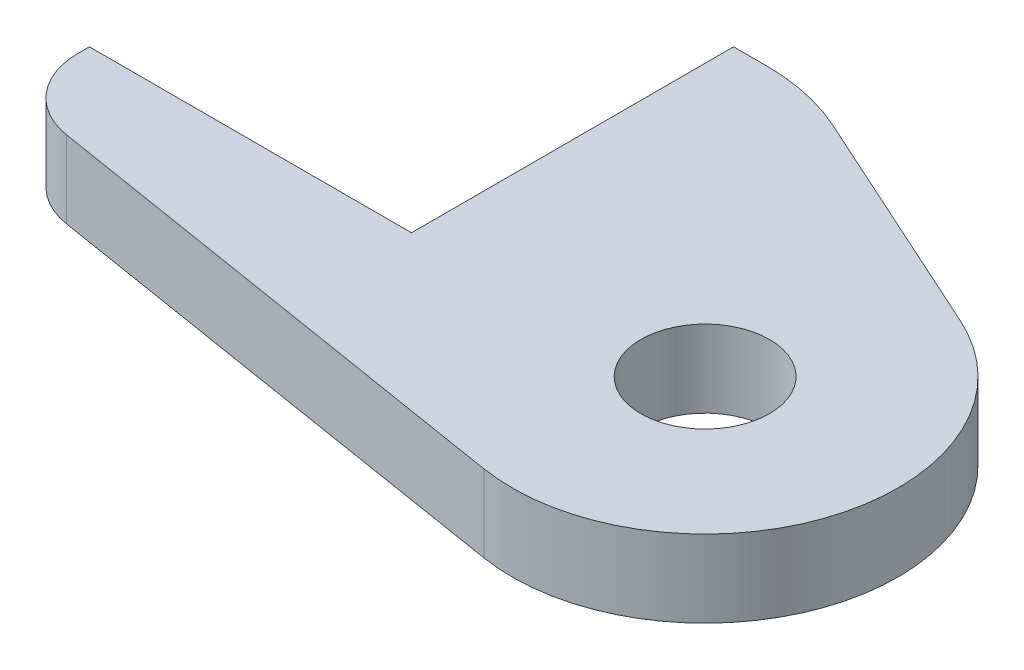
ISO-10303-21;
HEADER;
FILE_DESCRIPTION(('STEP AP214'),'2;1');
FILE_NAME('part.step','',(''),(''),'','','');
FILE_SCHEMA(('AUTOMOTIVE_DESIGN { 1 0 10303 214 1 1 1 1 }'));
ENDSEC;
DATA;
#1=APPLICATION_CONTEXT('core data for automotive mechanical design processes');
#2=APPLICATION_PROTOCOL_DEFINITION('international standard','automotive_design',2000,#1);
#3=PRODUCT_CONTEXT('',#1,'mechanical');
#4=PRODUCT('Part','Part','',(#3));
#5=PRODUCT_RELATED_PRODUCT_CATEGORY('part','',(#4));
#6=PRODUCT_DEFINITION_FORMATION('','',#4);
#7=PRODUCT_DEFINITION_CONTEXT('part definition',#1,'design');
#8=PRODUCT_DEFINITION('design','',#6,#7);
#9=PRODUCT_DEFINITION_SHAPE('','',#8);
#10=(LENGTH_UNIT() NAMED_UNIT(*) SI_UNIT(.MILLI.,.METRE.));
#11=(NAMED_UNIT(*) PLANE_ANGLE_UNIT() SI_UNIT($,.RADIAN.));
#12=(NAMED_UNIT(*) SI_UNIT($,.STERADIAN.) SOLID_ANGLE_UNIT());
#13=UNCERTAINTY_MEASURE_WITH_UNIT(LENGTH_MEASURE(1.E-05),#10,'distance_accuracy_value','');
#14=(GEOMETRIC_REPRESENTATION_CONTEXT(3) GLOBAL_UNCERTAINTY_ASSIGNED_CONTEXT((#13)) GLOBAL_UNIT_ASSIGNED_CONTEXT((#10,
#11,#12)) REPRESENTATION_CONTEXT('',''));
#15=CARTESIAN_POINT('',(0.,0.,0.));
#16=DIRECTION('',(0.,0.,1.));
#17=DIRECTION('',(1.,0.,0.));
#18=AXIS2_PLACEMENT_3D('',#15,#16,#17);
#19=CARTESIAN_POINT('',(197.104,4.7625,-155.428217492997));
#20=DIRECTION('',(0.,1.,0.));
#21=DIRECTION('',(0.,0.,1.));
#22=AXIS2_PLACEMENT_3D('',#19,#20,#21);
#23=PLANE('',#22);
#24=DIRECTION('',(0.,0.,1.));
#25=VECTOR('',#24,1.);
#26=CARTESIAN_POINT('',(227.33,4.7625,-160.02));
#27=LINE('',#26,#25);
#28=CARTESIAN_POINT('',(227.33,4.7625,-196.596));
#29=VERTEX_POINT('',#28);
#30=CARTESIAN_POINT('',(227.33,4.7625,-156.845));
#31=VERTEX_POINT('',#30);
#32=EDGE_CURVE('E194',#29,#31,#27,.T.);
#33=ORIENTED_EDGE('',*,*,#32,.T.);
#34=DIRECTION('',(-1.,0.,0.));
#35=VECTOR('',#34,1.);
#36=CARTESIAN_POINT('',(187.579,4.7625,-156.845));
#37=LINE('',#36,#35);
#38=CARTESIAN_POINT('',(187.579,4.7625,-156.845));
#39=VERTEX_POINT('',#38);
#40=EDGE_CURVE('E130',#31,#39,#37,.T.);
#41=ORIENTED_EDGE('',*,*,#40,.T.);
#42=DIRECTION('',(0.,0.,1.));
#43=VECTOR('',#42,1.);
#44=CARTESIAN_POINT('',(187.579,4.7625,-160.02));
#45=LINE('',#44,#43);
#46=CARTESIAN_POINT('',(187.579,4.7625,-155.428217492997));
#47=VERTEX_POINT('',#46);
#48=EDGE_CURVE('E123',#39,#47,#45,.T.);
#49=ORIENTED_EDGE('',*,*,#48,.T.);
#50=CARTESIAN_POINT('',(197.104,4.7625,-155.428217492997));
#51=DIRECTION('',(0.,1.,0.));
#52=DIRECTION('',(0.,0.,1.));
#53=AXIS2_PLACEMENT_3D('',#50,#51,#52);
#54=CIRCLE('',#53,9.52499999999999);
#55=CARTESIAN_POINT('',(195.583200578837,4.7625,-146.025409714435));
#56=VERTEX_POINT('',#55);
#57=EDGE_CURVE('E127',#47,#56,#54,.T.);
#58=ORIENTED_EDGE('',*,*,#57,.T.);
#59=DIRECTION('',(0.987171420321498,0.,0.159663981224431));
#60=VECTOR('',#59,1.);
#61=CARTESIAN_POINT('',(195.583200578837,4.7625,-146.025409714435));
#62=LINE('',#61,#60);
#63=CARTESIAN_POINT('',(257.014091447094,4.7625,-136.089647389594));
#64=VERTEX_POINT('',#63);
#65=EDGE_CURVE('E146',#56,#64,#62,.T.);
#66=ORIENTED_EDGE('',*,*,#65,.T.);
#67=CARTESIAN_POINT('',(260.81609,4.7625,-159.596666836));
#68=DIRECTION('',(0.,1.,0.));
#69=DIRECTION('',(0.,0.,1.));
#70=AXIS2_PLACEMENT_3D('',#67,#68,#69);
#71=CIRCLE('',#70,23.8125);
#72=CARTESIAN_POINT('',(270.643643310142,4.7625,-181.286626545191));
#73=VERTEX_POINT('',#72);
#74=EDGE_CURVE('E148',#64,#73,#71,.T.);
#75=ORIENTED_EDGE('',*,*,#74,.T.);
#76=DIRECTION('',(-0.910864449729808,0.,-0.412705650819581));
#77=VECTOR('',#76,1.);
#78=CARTESIAN_POINT('',(241.851869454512,4.7625,-194.331957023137));
#79=LINE('',#78,#77);
#80=CARTESIAN_POINT('',(241.851869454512,4.7625,-194.331957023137));
#81=VERTEX_POINT('',#80);
#82=EDGE_CURVE('E153',#73,#81,#79,.T.);
#83=ORIENTED_EDGE('',*,*,#82,.T.);
#84=CARTESIAN_POINT('',(231.369145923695,4.7625,-171.196));
#85=DIRECTION('',(0.,1.,0.));
#86=DIRECTION('',(0.,0.,-1.));
#87=AXIS2_PLACEMENT_3D('',#84,#85,#86);
#88=CIRCLE('',#87,25.4);
#89=CARTESIAN_POINT('',(231.369145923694,4.7625,-196.596));
#90=VERTEX_POINT('',#89);
#91=EDGE_CURVE('E155',#81,#90,#88,.T.);
#92=ORIENTED_EDGE('',*,*,#91,.T.);
#93=DIRECTION('',(-1.,0.,0.));
#94=VECTOR('',#93,1.);
#95=CARTESIAN_POINT('',(224.155,4.7625,-196.596));
#96=LINE('',#95,#94);
#97=EDGE_CURVE('E157',#90,#29,#96,.T.);
#98=ORIENTED_EDGE('',*,*,#97,.T.);
#99=EDGE_LOOP('',(#33,#41,#49,#58,#66,#75,#83,#92,#98));
#100=FACE_BOUND('',#99,.T.);
#101=CARTESIAN_POINT('',(260.81609,4.7625,-159.596666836));
#102=DIRECTION('',(0.,1.,0.));
#103=DIRECTION('',(0.,0.,1.));
#104=AXIS2_PLACEMENT_3D('',#101,#102,#103);
#105=CIRCLE('',#104,7.93749999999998);
#106=CARTESIAN_POINT('',(260.81609,4.7625,-167.534166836));
#107=VERTEX_POINT('',#106);
#108=EDGE_CURVE('E163',#107,#107,#105,.T.);
#109=ORIENTED_EDGE('',*,*,#108,.F.);
#110=EDGE_LOOP('',(#109));
#111=FACE_BOUND('',#110,.T.);
#112=ADVANCED_FACE('F34',(#100,#111),#23,.T.);
#113=CARTESIAN_POINT('',(197.104,-4.7625,-155.428217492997));
#114=DIRECTION('',(0.,1.,0.));
#115=DIRECTION('',(0.,0.,1.));
#116=AXIS2_PLACEMENT_3D('',#113,#114,#115);
#117=PLANE('',#116);
#118=DIRECTION('',(0.,0.,1.));
#119=VECTOR('',#118,1.);
#120=CARTESIAN_POINT('',(187.579,-4.7625,-160.02));
#121=LINE('',#120,#119);
#122=CARTESIAN_POINT('',(187.579,-4.7625,-156.845));
#123=VERTEX_POINT('',#122);
#124=CARTESIAN_POINT('',(187.579,-4.7625,-155.428217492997));
#125=VERTEX_POINT('',#124);
#126=EDGE_CURVE('E137',#123,#125,#121,.T.);
#127=ORIENTED_EDGE('',*,*,#126,.F.);
#128=DIRECTION('',(1.,0.,0.));
#129=VECTOR('',#128,1.);
#130=CARTESIAN_POINT('',(197.104,-4.7625,-156.845));
#131=LINE('',#130,#129);
#132=CARTESIAN_POINT('',(227.33,-4.7625,-156.845));
#133=VERTEX_POINT('',#132);
#134=EDGE_CURVE('E11',#123,#133,#131,.T.);
#135=ORIENTED_EDGE('',*,*,#134,.T.);
#136=DIRECTION('',(0.,0.,-1.));
#137=VECTOR('',#136,1.);
#138=CARTESIAN_POINT('',(227.33,-4.7625,-155.428217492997));
#139=LINE('',#138,#137);
#140=CARTESIAN_POINT('',(227.33,-4.7625,-196.596));
#141=VERTEX_POINT('',#140);
#142=EDGE_CURVE('E44',#133,#141,#139,.T.);
#143=ORIENTED_EDGE('',*,*,#142,.T.);
#144=DIRECTION('',(-1.,0.,0.));
#145=VECTOR('',#144,1.);
#146=CARTESIAN_POINT('',(224.155,-4.7625,-196.596));
#147=LINE('',#146,#145);
#148=CARTESIAN_POINT('',(231.369145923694,-4.7625,-196.596));
#149=VERTEX_POINT('',#148);
#150=EDGE_CURVE('E132',#149,#141,#147,.T.);
#151=ORIENTED_EDGE('',*,*,#150,.F.);
#152=CARTESIAN_POINT('',(231.369145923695,-4.7625,-171.196));
#153=DIRECTION('',(0.,1.,0.));
#154=DIRECTION('',(0.,0.,-1.));
#155=AXIS2_PLACEMENT_3D('',#152,#153,#154);
#156=CIRCLE('',#155,25.4);
#157=CARTESIAN_POINT('',(241.851869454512,-4.7625,-194.331957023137));
#158=VERTEX_POINT('',#157);
#159=EDGE_CURVE('E171',#158,#149,#156,.T.);
#160=ORIENTED_EDGE('',*,*,#159,.F.);
#161=DIRECTION('',(-0.910864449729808,0.,-0.412705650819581));
#162=VECTOR('',#161,1.);
#163=CARTESIAN_POINT('',(241.851869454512,-4.7625,-194.331957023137));
#164=LINE('',#163,#162);
#165=CARTESIAN_POINT('',(270.643643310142,-4.7625,-181.286626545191));
#166=VERTEX_POINT('',#165);
#167=EDGE_CURVE('E169',#166,#158,#164,.T.);
#168=ORIENTED_EDGE('',*,*,#167,.F.);
#169=CARTESIAN_POINT('',(260.81609,-4.7625,-159.596666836));
#170=DIRECTION('',(0.,1.,0.));
#171=DIRECTION('',(0.,0.,1.));
#172=AXIS2_PLACEMENT_3D('',#169,#170,#171);
#173=CIRCLE('',#172,23.8125);
#174=CARTESIAN_POINT('',(257.014091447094,-4.7625,-136.089647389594));
#175=VERTEX_POINT('',#174);
#176=EDGE_CURVE('E167',#175,#166,#173,.T.);
#177=ORIENTED_EDGE('',*,*,#176,.F.);
#178=DIRECTION('',(0.987171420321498,0.,0.159663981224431));
#179=VECTOR('',#178,1.);
#180=CARTESIAN_POINT('',(195.583200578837,-4.7625,-146.025409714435));
#181=LINE('',#180,#179);
#182=CARTESIAN_POINT('',(195.583200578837,-4.7625,-146.025409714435));
#183=VERTEX_POINT('',#182);
#184=EDGE_CURVE('E165',#183,#175,#181,.T.);
#185=ORIENTED_EDGE('',*,*,#184,.F.);
#186=CARTESIAN_POINT('',(197.104,-4.7625,-155.428217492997));
#187=DIRECTION('',(0.,1.,0.));
#188=DIRECTION('',(0.,0.,1.));
#189=AXIS2_PLACEMENT_3D('',#186,#187,#188);
#190=CIRCLE('',#189,9.52499999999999);
#191=EDGE_CURVE('E162',#125,#183,#190,.T.);
#192=ORIENTED_EDGE('',*,*,#191,.F.);
#193=EDGE_LOOP('',(#127,#135,#143,#151,#160,#168,#177,#185,#192));
#194=FACE_BOUND('',#193,.T.);
#195=CARTESIAN_POINT('',(260.81609,-4.7625,-159.596666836));
#196=DIRECTION('',(0.,1.,0.));
#197=DIRECTION('',(0.,0.,1.));
#198=AXIS2_PLACEMENT_3D('',#195,#196,#197);
#199=CIRCLE('',#198,7.93749999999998);
#200=CARTESIAN_POINT('',(260.81609,-4.7625,-167.534166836));
#201=VERTEX_POINT('',#200);
#202=EDGE_CURVE('E216',#201,#201,#199,.T.);
#203=ORIENTED_EDGE('',*,*,#202,.T.);
#204=EDGE_LOOP('',(#203));
#205=FACE_BOUND('',#204,.T.);
#206=ADVANCED_FACE('F248',(#194,#205),#117,.F.);
#207=CARTESIAN_POINT('',(224.155,4.7625,-160.02));
#208=DIRECTION('',(0.,0.,1.));
#209=DIRECTION('',(1.,0.,0.));
#210=AXIS2_PLACEMENT_3D('',#207,#208,#209);
#211=PLANE('',#210);
#212=DIRECTION('',(0.,-1.,0.));
#213=VECTOR('',#212,1.);
#214=CARTESIAN_POINT('',(187.579,4.7625,-160.02));
#215=LINE('',#214,#213);
#216=CARTESIAN_POINT('',(187.579,1.5875,-160.02));
#217=VERTEX_POINT('',#216);
#218=CARTESIAN_POINT('',(187.579,-1.5875,-160.02));
#219=VERTEX_POINT('',#218);
#220=EDGE_CURVE('E140',#217,#219,#215,.T.);
#221=ORIENTED_EDGE('',*,*,#220,.F.);
#222=DIRECTION('',(1.,0.,0.));
#223=VECTOR('',#222,1.);
#224=CARTESIAN_POINT('',(224.155,1.5875,-160.02));
#225=LINE('',#224,#223);
#226=CARTESIAN_POINT('',(224.155,1.5875,-160.02));
#227=VERTEX_POINT('',#226);
#228=EDGE_CURVE('E204',#217,#227,#225,.T.);
#229=ORIENTED_EDGE('',*,*,#228,.T.);
#230=DIRECTION('',(0.,-1.,0.));
#231=VECTOR('',#230,1.);
#232=CARTESIAN_POINT('',(224.155,4.7625,-160.02));
#233=LINE('',#232,#231);
#234=CARTESIAN_POINT('',(224.155,-1.5875,-160.02));
#235=VERTEX_POINT('',#234);
#236=EDGE_CURVE('E160',#227,#235,#233,.T.);
#237=ORIENTED_EDGE('',*,*,#236,.T.);
#238=DIRECTION('',(-1.,0.,0.));
#239=VECTOR('',#238,1.);
#240=CARTESIAN_POINT('',(224.155,-1.5875,-160.02));
#241=LINE('',#240,#239);
#242=EDGE_CURVE('E201',#235,#219,#241,.T.);
#243=ORIENTED_EDGE('',*,*,#242,.T.);
#244=EDGE_LOOP('',(#221,#229,#237,#243));
#245=FACE_BOUND('',#244,.T.);
#246=ADVANCED_FACE('F275',(#245),#211,.F.);
#247=CARTESIAN_POINT('',(187.579,4.7625,-160.02));
#248=DIRECTION('',(1.,0.,0.));
#249=DIRECTION('',(0.,0.,-1.));
#250=AXIS2_PLACEMENT_3D('',#247,#248,#249);
#251=PLANE('',#250);
#252=ORIENTED_EDGE('',*,*,#48,.F.);
#253=DIRECTION('',(0.,-0.707106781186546,-0.707106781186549));
#254=VECTOR('',#253,1.);
#255=CARTESIAN_POINT('',(187.579,4.7625,-156.845));
#256=LINE('',#255,#254);
#257=EDGE_CURVE('E199',#39,#217,#256,.T.);
#258=ORIENTED_EDGE('',*,*,#257,.T.);
#259=ORIENTED_EDGE('',*,*,#220,.T.);
#260=DIRECTION('',(0.,0.707106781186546,-0.707106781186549));
#261=VECTOR('',#260,1.);
#262=CARTESIAN_POINT('',(187.579,-1.5875,-160.02));
#263=LINE('',#262,#261);
#264=EDGE_CURVE('E197',#219,#123,#263,.F.);
#265=ORIENTED_EDGE('',*,*,#264,.T.);
#266=ORIENTED_EDGE('',*,*,#126,.T.);
#267=DIRECTION('',(0.,-1.,0.));
#268=VECTOR('',#267,1.);
#269=CARTESIAN_POINT('',(187.579,4.7625,-155.428217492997));
#270=LINE('',#269,#268);
#271=EDGE_CURVE('E135',#47,#125,#270,.T.);
#272=ORIENTED_EDGE('',*,*,#271,.F.);
#273=EDGE_LOOP('',(#252,#258,#259,#265,#266,#272));
#274=FACE_BOUND('',#273,.T.);
#275=ADVANCED_FACE('F136',(#274),#251,.F.);
#276=CARTESIAN_POINT('',(197.104,4.7625,-155.428217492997));
#277=DIRECTION('',(0.,-1.,0.));
#278=DIRECTION('',(0.,0.,-1.));
#279=AXIS2_PLACEMENT_3D('',#276,#277,#278);
#280=CYLINDRICAL_SURFACE('',#279,9.52499999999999);
#281=ORIENTED_EDGE('',*,*,#191,.T.);
#282=DIRECTION('',(0.,-1.,0.));
#283=VECTOR('',#282,1.);
#284=CARTESIAN_POINT('',(195.583200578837,4.7625,-146.025409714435));
#285=LINE('',#284,#283);
#286=EDGE_CURVE('E141',#56,#183,#285,.T.);
#287=ORIENTED_EDGE('',*,*,#286,.F.);
#288=ORIENTED_EDGE('',*,*,#57,.F.);
#289=ORIENTED_EDGE('',*,*,#271,.T.);
#290=EDGE_LOOP('',(#281,#287,#288,#289));
#291=FACE_BOUND('',#290,.T.);
#292=ADVANCED_FACE('F143',(#291),#280,.T.);
#293=CARTESIAN_POINT('',(195.583200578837,4.7625,-146.025409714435));
#294=DIRECTION('',(0.159663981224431,0.,-0.987171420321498));
#295=DIRECTION('',(-0.987171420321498,0.,-0.159663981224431));
#296=AXIS2_PLACEMENT_3D('',#293,#294,#295);
#297=PLANE('',#296);
#298=ORIENTED_EDGE('',*,*,#184,.T.);
#299=DIRECTION('',(0.,-1.,0.));
#300=VECTOR('',#299,1.);
#301=CARTESIAN_POINT('',(257.014091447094,4.7625,-136.089647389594));
#302=LINE('',#301,#300);
#303=EDGE_CURVE('E188',#64,#175,#302,.T.);
#304=ORIENTED_EDGE('',*,*,#303,.F.);
#305=ORIENTED_EDGE('',*,*,#65,.F.);
#306=ORIENTED_EDGE('',*,*,#286,.T.);
#307=EDGE_LOOP('',(#298,#304,#305,#306));
#308=FACE_BOUND('',#307,.T.);
#309=ADVANCED_FACE('F261',(#308),#297,.F.);
#310=CARTESIAN_POINT('',(260.81609,4.7625,-159.596666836));
#311=DIRECTION('',(0.,-1.,0.));
#312=DIRECTION('',(0.,0.,-1.));
#313=AXIS2_PLACEMENT_3D('',#310,#311,#312);
#314=CYLINDRICAL_SURFACE('',#313,23.8125);
#315=ORIENTED_EDGE('',*,*,#176,.T.);
#316=DIRECTION('',(0.,-1.,0.));
#317=VECTOR('',#316,1.);
#318=CARTESIAN_POINT('',(270.643643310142,4.7625,-181.286626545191));
#319=LINE('',#318,#317);
#320=EDGE_CURVE('E185',#73,#166,#319,.T.);
#321=ORIENTED_EDGE('',*,*,#320,.F.);
#322=ORIENTED_EDGE('',*,*,#74,.F.);
#323=ORIENTED_EDGE('',*,*,#303,.T.);
#324=EDGE_LOOP('',(#315,#321,#322,#323));
#325=FACE_BOUND('',#324,.T.);
#326=ADVANCED_FACE('F258',(#325),#314,.T.);
#327=CARTESIAN_POINT('',(241.851869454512,4.7625,-194.331957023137));
#328=DIRECTION('',(-0.412705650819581,0.,0.910864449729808));
#329=DIRECTION('',(0.910864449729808,0.,0.412705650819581));
#330=AXIS2_PLACEMENT_3D('',#327,#328,#329);
#331=PLANE('',#330);
#332=ORIENTED_EDGE('',*,*,#167,.T.);
#333=DIRECTION('',(0.,-1.,0.));
#334=VECTOR('',#333,1.);
#335=CARTESIAN_POINT('',(241.851869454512,4.7625,-194.331957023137));
#336=LINE('',#335,#334);
#337=EDGE_CURVE('E182',#81,#158,#336,.T.);
#338=ORIENTED_EDGE('',*,*,#337,.F.);
#339=ORIENTED_EDGE('',*,*,#82,.F.);
#340=ORIENTED_EDGE('',*,*,#320,.T.);
#341=EDGE_LOOP('',(#332,#338,#339,#340));
#342=FACE_BOUND('',#341,.T.);
#343=ADVANCED_FACE('F254',(#342),#331,.F.);
#344=CARTESIAN_POINT('',(231.369145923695,4.7625,-171.196));
#345=DIRECTION('',(0.,-1.,0.));
#346=DIRECTION('',(0.,0.,-1.));
#347=AXIS2_PLACEMENT_3D('',#344,#345,#346);
#348=CYLINDRICAL_SURFACE('',#347,25.4);
#349=ORIENTED_EDGE('',*,*,#159,.T.);
#350=DIRECTION('',(0.,-1.,0.));
#351=VECTOR('',#350,1.);
#352=CARTESIAN_POINT('',(231.369145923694,4.7625,-196.596));
#353=LINE('',#352,#351);
#354=EDGE_CURVE('E179',#90,#149,#353,.T.);
#355=ORIENTED_EDGE('',*,*,#354,.F.);
#356=ORIENTED_EDGE('',*,*,#91,.F.);
#357=ORIENTED_EDGE('',*,*,#337,.T.);
#358=EDGE_LOOP('',(#349,#355,#356,#357));
#359=FACE_BOUND('',#358,.T.);
#360=ADVANCED_FACE('F246',(#359),#348,.T.);
#361=CARTESIAN_POINT('',(224.155,4.7625,-196.596));
#362=DIRECTION('',(0.,0.,1.));
#363=DIRECTION('',(1.,0.,0.));
#364=AXIS2_PLACEMENT_3D('',#361,#362,#363);
#365=PLANE('',#364);
#366=DIRECTION('',(0.,-1.,0.));
#367=VECTOR('',#366,1.);
#368=CARTESIAN_POINT('',(224.155,4.7625,-196.596));
#369=LINE('',#368,#367);
#370=CARTESIAN_POINT('',(224.155,1.5875,-196.596));
#371=VERTEX_POINT('',#370);
#372=CARTESIAN_POINT('',(224.155,-1.5875,-196.596));
#373=VERTEX_POINT('',#372);
#374=EDGE_CURVE('E176',#371,#373,#369,.T.);
#375=ORIENTED_EDGE('',*,*,#374,.F.);
#376=DIRECTION('',(0.70710678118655,0.707106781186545,0.));
#377=VECTOR('',#376,1.);
#378=CARTESIAN_POINT('',(227.33,4.76249999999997,-196.596));
#379=LINE('',#378,#377);
#380=EDGE_CURVE('E212',#371,#29,#379,.T.);
#381=ORIENTED_EDGE('',*,*,#380,.T.);
#382=ORIENTED_EDGE('',*,*,#97,.F.);
#383=ORIENTED_EDGE('',*,*,#354,.T.);
#384=ORIENTED_EDGE('',*,*,#150,.T.);
#385=DIRECTION('',(0.70710678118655,-0.707106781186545,0.));
#386=VECTOR('',#385,1.);
#387=CARTESIAN_POINT('',(224.155,-1.58749999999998,-196.596));
#388=LINE('',#387,#386);
#389=EDGE_CURVE('E210',#141,#373,#388,.F.);
#390=ORIENTED_EDGE('',*,*,#389,.T.);
#391=EDGE_LOOP('',(#375,#381,#382,#383,#384,#390));
#392=FACE_BOUND('',#391,.T.);
#393=ADVANCED_FACE('F231',(#392),#365,.F.);
#394=CARTESIAN_POINT('',(224.155,4.7625,-160.02));
#395=DIRECTION('',(1.,0.,0.));
#396=DIRECTION('',(0.,0.,-1.));
#397=AXIS2_PLACEMENT_3D('',#394,#395,#396);
#398=PLANE('',#397);
#399=ORIENTED_EDGE('',*,*,#236,.F.);
#400=DIRECTION('',(0.,0.,-1.));
#401=VECTOR('',#400,1.);
#402=CARTESIAN_POINT('',(224.155,1.5875,-196.596));
#403=LINE('',#402,#401);
#404=EDGE_CURVE('E208',#227,#371,#403,.T.);
#405=ORIENTED_EDGE('',*,*,#404,.T.);
#406=ORIENTED_EDGE('',*,*,#374,.T.);
#407=DIRECTION('',(0.,0.,1.));
#408=VECTOR('',#407,1.);
#409=CARTESIAN_POINT('',(224.155,-1.5875,-160.02));
#410=LINE('',#409,#408);
#411=EDGE_CURVE('E206',#373,#235,#410,.T.);
#412=ORIENTED_EDGE('',*,*,#411,.T.);
#413=EDGE_LOOP('',(#399,#405,#406,#412));
#414=FACE_BOUND('',#413,.T.);
#415=ADVANCED_FACE('F235',(#414),#398,.F.);
#416=CARTESIAN_POINT('',(260.81609,4.7625,-159.596666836));
#417=DIRECTION('',(0.,-1.,0.));
#418=DIRECTION('',(0.,0.,-1.));
#419=AXIS2_PLACEMENT_3D('',#416,#417,#418);
#420=CYLINDRICAL_SURFACE('',#419,7.93749999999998);
#421=CARTESIAN_POINT('',(260.81609,4.7625,-167.534166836));
#422=CARTESIAN_POINT('',(260.81609,4.66328125,-167.534166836));
#423=CARTESIAN_POINT('',(260.81609,4.5640625,-167.534166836));
#424=CARTESIAN_POINT('',(260.81609,4.365625,-167.534166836));
#425=CARTESIAN_POINT('',(260.81609,4.26640625,-167.534166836));
#426=CARTESIAN_POINT('',(260.81609,4.06796875,-167.534166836));
#427=CARTESIAN_POINT('',(260.81609,3.96875,-167.534166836));
#428=CARTESIAN_POINT('',(260.81609,3.7703125,-167.534166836));
#429=CARTESIAN_POINT('',(260.81609,3.67109375,-167.534166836));
#430=CARTESIAN_POINT('',(260.81609,3.47265625,-167.534166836));
#431=CARTESIAN_POINT('',(260.81609,3.3734375,-167.534166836));
#432=CARTESIAN_POINT('',(260.81609,3.175,-167.534166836));
#433=CARTESIAN_POINT('',(260.81609,3.07578125,-167.534166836));
#434=CARTESIAN_POINT('',(260.81609,2.87734375,-167.534166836));
#435=CARTESIAN_POINT('',(260.81609,2.778125,-167.534166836));
#436=CARTESIAN_POINT('',(260.81609,2.5796875,-167.534166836));
#437=CARTESIAN_POINT('',(260.81609,2.48046875,-167.534166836));
#438=CARTESIAN_POINT('',(260.81609,2.28203125,-167.534166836));
#439=CARTESIAN_POINT('',(260.81609,2.1828125,-167.534166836));
#440=CARTESIAN_POINT('',(260.81609,1.984375,-167.534166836));
#441=CARTESIAN_POINT('',(260.81609,1.88515625,-167.534166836));
#442=CARTESIAN_POINT('',(260.81609,1.68671875,-167.534166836));
#443=CARTESIAN_POINT('',(260.81609,1.5875,-167.534166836));
#444=CARTESIAN_POINT('',(260.81609,1.3890625,-167.534166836));
#445=CARTESIAN_POINT('',(260.81609,1.28984375,-167.534166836));
#446=CARTESIAN_POINT('',(260.81609,1.09140625,-167.534166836));
#447=CARTESIAN_POINT('',(260.81609,0.992187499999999,-167.534166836));
#448=CARTESIAN_POINT('',(260.81609,0.79375,-167.534166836));
#449=CARTESIAN_POINT('',(260.81609,0.69453125,-167.534166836));
#450=CARTESIAN_POINT('',(260.81609,0.49609375,-167.534166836));
#451=CARTESIAN_POINT('',(260.81609,0.396875,-167.534166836));
#452=CARTESIAN_POINT('',(260.81609,0.1984375,-167.534166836));
#453=CARTESIAN_POINT('',(260.81609,0.0992187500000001,-167.534166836));
#454=CARTESIAN_POINT('',(260.81609,-0.0992187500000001,-167.534166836));
#455=CARTESIAN_POINT('',(260.81609,-0.1984375,-167.534166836));
#456=CARTESIAN_POINT('',(260.81609,-0.396875,-167.534166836));
#457=CARTESIAN_POINT('',(260.81609,-0.49609375,-167.534166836));
#458=CARTESIAN_POINT('',(260.81609,-0.69453125,-167.534166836));
#459=CARTESIAN_POINT('',(260.81609,-0.793750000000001,-167.534166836));
#460=CARTESIAN_POINT('',(260.81609,-0.992187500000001,-167.534166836));
#461=CARTESIAN_POINT('',(260.81609,-1.09140625,-167.534166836));
#462=CARTESIAN_POINT('',(260.81609,-1.28984375,-167.534166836));
#463=CARTESIAN_POINT('',(260.81609,-1.3890625,-167.534166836));
#464=CARTESIAN_POINT('',(260.81609,-1.5875,-167.534166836));
#465=CARTESIAN_POINT('',(260.81609,-1.68671875,-167.534166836));
#466=CARTESIAN_POINT('',(260.81609,-1.88515625,-167.534166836));
#467=CARTESIAN_POINT('',(260.81609,-1.984375,-167.534166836));
#468=CARTESIAN_POINT('',(260.81609,-2.1828125,-167.534166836));
#469=CARTESIAN_POINT('',(260.81609,-2.28203125,-167.534166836));
#470=CARTESIAN_POINT('',(260.81609,-2.48046875,-167.534166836));
#471=CARTESIAN_POINT('',(260.81609,-2.5796875,-167.534166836));
#472=CARTESIAN_POINT('',(260.81609,-2.778125,-167.534166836));
#473=CARTESIAN_POINT('',(260.81609,-2.87734375,-167.534166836));
#474=CARTESIAN_POINT('',(260.81609,-3.07578125,-167.534166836));
#475=CARTESIAN_POINT('',(260.81609,-3.175,-167.534166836));
#476=CARTESIAN_POINT('',(260.81609,-3.3734375,-167.534166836));
#477=CARTESIAN_POINT('',(260.81609,-3.47265625,-167.534166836));
#478=CARTESIAN_POINT('',(260.81609,-3.67109375,-167.534166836));
#479=CARTESIAN_POINT('',(260.81609,-3.7703125,-167.534166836));
#480=CARTESIAN_POINT('',(260.81609,-3.96875,-167.534166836));
#481=CARTESIAN_POINT('',(260.81609,-4.06796875,-167.534166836));
#482=CARTESIAN_POINT('',(260.81609,-4.26640625,-167.534166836));
#483=CARTESIAN_POINT('',(260.81609,-4.365625,-167.534166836));
#484=CARTESIAN_POINT('',(260.81609,-4.5640625,-167.534166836));
#485=CARTESIAN_POINT('',(260.81609,-4.66328125,-167.534166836));
#486=CARTESIAN_POINT('',(260.81609,-4.7625,-167.534166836));
#487=B_SPLINE_CURVE_WITH_KNOTS('',3,(#421,#422,#423,#424,#425,#426,#427,#428,#429,#430,#431,
#432,#433,#434,#435,#436,#437,#438,#439,#440,#441,#442,#443,#444,#445,#446,#447,#448,#449,#450,
#451,#452,#453,#454,#455,#456,#457,#458,#459,#460,#461,#462,#463,#464,#465,#466,#467,#468,#469,
#470,#471,#472,#473,#474,#475,#476,#477,#478,#479,#480,#481,#482,#483,#484,#485,#486),
.UNSPECIFIED.,.F.,.F.,(4,2,2,2,2,2,2,2,2,2,2,2,2,2,2,2,2,2,2,2,2,2,2,2,2,2,2,2,2,2,2,2,4),(0.,
0.29765625,0.5953125,0.892968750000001,1.190625,1.48828125,1.7859375,2.08359375,2.38125,
2.67890625,2.9765625,3.27421875,3.571875,3.86953125,4.1671875,4.46484375,4.7625,5.06015625,
5.3578125,5.65546875,5.953125,6.25078125,6.5484375,6.84609375,7.14375,7.44140625,7.7390625,
8.03671875,8.334375,8.63203125,8.9296875,9.22734375,9.525),.UNSPECIFIED.);
#488=EDGE_CURVE('BSEAM278',#107,#201,#487,.T.);
#489=ORIENTED_EDGE('',*,*,#108,.T.);
#490=ORIENTED_EDGE('',*,*,#202,.F.);
#491=ORIENTED_EDGE('',*,*,#488,.T.);
#492=ORIENTED_EDGE('',*,*,#488,.F.);
#493=EDGE_LOOP('',(#489,#491,#490,#492));
#494=FACE_BOUND('',#493,.T.);
#495=ADVANCED_FACE('F278',(#494),#420,.F.);
#496=CARTESIAN_POINT('',(227.33,4.7625,-155.428217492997));
#497=DIRECTION('',(-0.707106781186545,0.70710678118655,0.));
#498=DIRECTION('',(0.,0.,-1.));
#499=AXIS2_PLACEMENT_3D('',#496,#497,#498);
#500=PLANE('',#499);
#501=ORIENTED_EDGE('',*,*,#380,.F.);
#502=ORIENTED_EDGE('',*,*,#404,.F.);
#503=DIRECTION('',(0.577350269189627,0.577350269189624,0.577350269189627));
#504=VECTOR('',#503,1.);
#505=CARTESIAN_POINT('',(217.254666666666,-5.31283333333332,-166.920333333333));
#506=LINE('',#505,#504);
#507=EDGE_CURVE('E214',#31,#227,#506,.F.);
#508=ORIENTED_EDGE('',*,*,#507,.F.);
#509=ORIENTED_EDGE('',*,*,#32,.F.);
#510=EDGE_LOOP('',(#501,#502,#508,#509));
#511=FACE_BOUND('',#510,.T.);
#512=ADVANCED_FACE('F238',(#511),#500,.T.);
#513=CARTESIAN_POINT('',(197.104,4.7625,-156.845));
#514=DIRECTION('',(0.,0.707106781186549,-0.707106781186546));
#515=DIRECTION('',(1.,0.,0.));
#516=AXIS2_PLACEMENT_3D('',#513,#514,#515);
#517=PLANE('',#516);
#518=ORIENTED_EDGE('',*,*,#507,.T.);
#519=ORIENTED_EDGE('',*,*,#228,.F.);
#520=ORIENTED_EDGE('',*,*,#257,.F.);
#521=ORIENTED_EDGE('',*,*,#40,.F.);
#522=EDGE_LOOP('',(#518,#519,#520,#521));
#523=FACE_BOUND('',#522,.T.);
#524=ADVANCED_FACE('F316',(#523),#517,.T.);
#525=CARTESIAN_POINT('',(224.155,-1.5875,-160.02));
#526=DIRECTION('',(0.707106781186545,0.70710678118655,0.));
#527=DIRECTION('',(0.,0.,1.));
#528=AXIS2_PLACEMENT_3D('',#525,#526,#527);
#529=PLANE('',#528);
#530=ORIENTED_EDGE('',*,*,#389,.F.);
#531=ORIENTED_EDGE('',*,*,#142,.F.);
#532=DIRECTION('',(-0.577350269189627,0.577350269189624,-0.577350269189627));
#533=VECTOR('',#532,1.);
#534=CARTESIAN_POINT('',(224.155,-1.5875,-160.02));
#535=LINE('',#534,#533);
#536=EDGE_CURVE('E39',#235,#133,#535,.F.);
#537=ORIENTED_EDGE('',*,*,#536,.F.);
#538=ORIENTED_EDGE('',*,*,#411,.F.);
#539=EDGE_LOOP('',(#530,#531,#537,#538));
#540=FACE_BOUND('',#539,.T.);
#541=ADVANCED_FACE('F37',(#540),#529,.F.);
#542=CARTESIAN_POINT('',(224.155,-1.5875,-160.02));
#543=DIRECTION('',(0.,0.707106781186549,0.707106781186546));
#544=DIRECTION('',(-1.,0.,0.));
#545=AXIS2_PLACEMENT_3D('',#542,#543,#544);
#546=PLANE('',#545);
#547=ORIENTED_EDGE('',*,*,#536,.T.);
#548=ORIENTED_EDGE('',*,*,#134,.F.);
#549=ORIENTED_EDGE('',*,*,#264,.F.);
#550=ORIENTED_EDGE('',*,*,#242,.F.);
#551=EDGE_LOOP('',(#547,#548,#549,#550));
#552=FACE_BOUND('',#551,.T.);
#553=ADVANCED_FACE('F225',(#552),#546,.F.);
#554=CLOSED_SHELL('',(#112,#206,#246,#275,#292,#309,#326,#343,#360,#393,#415,#495,#512,#524,
#541,#553));
#555=MANIFOLD_SOLID_BREP('B2',#554);
#556=ADVANCED_BREP_SHAPE_REPRESENTATION('',(#18,#555),#14);
#557=SHAPE_DEFINITION_REPRESENTATION(#9,#556);
ENDSEC;
END-ISO-10303-21;
